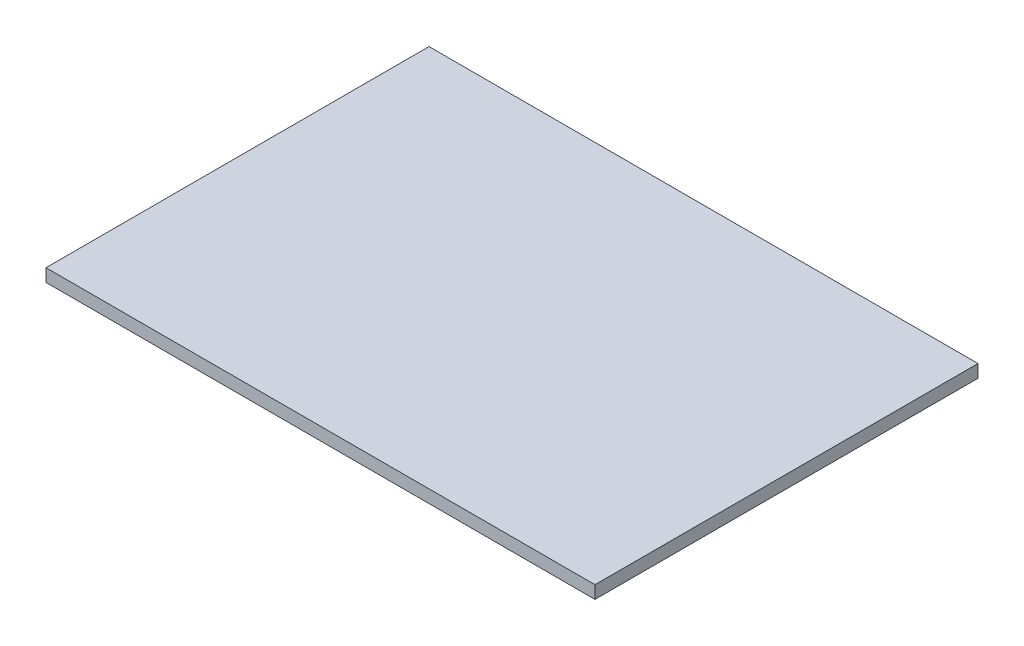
from build123d import *

# Parameters (mm, degrees)
SKETCH1_W           = 43
SKETCH1_H           = 30
BOSS_EXTRUDE1_DEPTH = 0.5


with BuildPart() as part:
    # Sketch1 → Boss-Extrude1 (new, symmetric)
    with BuildSketch(Plane(origin=(0, 0, 0), x_dir=(1, 0, 0), z_dir=(0, 1, 0))):
        Rectangle(SKETCH1_W, SKETCH1_H)
    extrude(amount=BOSS_EXTRUDE1_DEPTH, both=True)


solid = part.part
